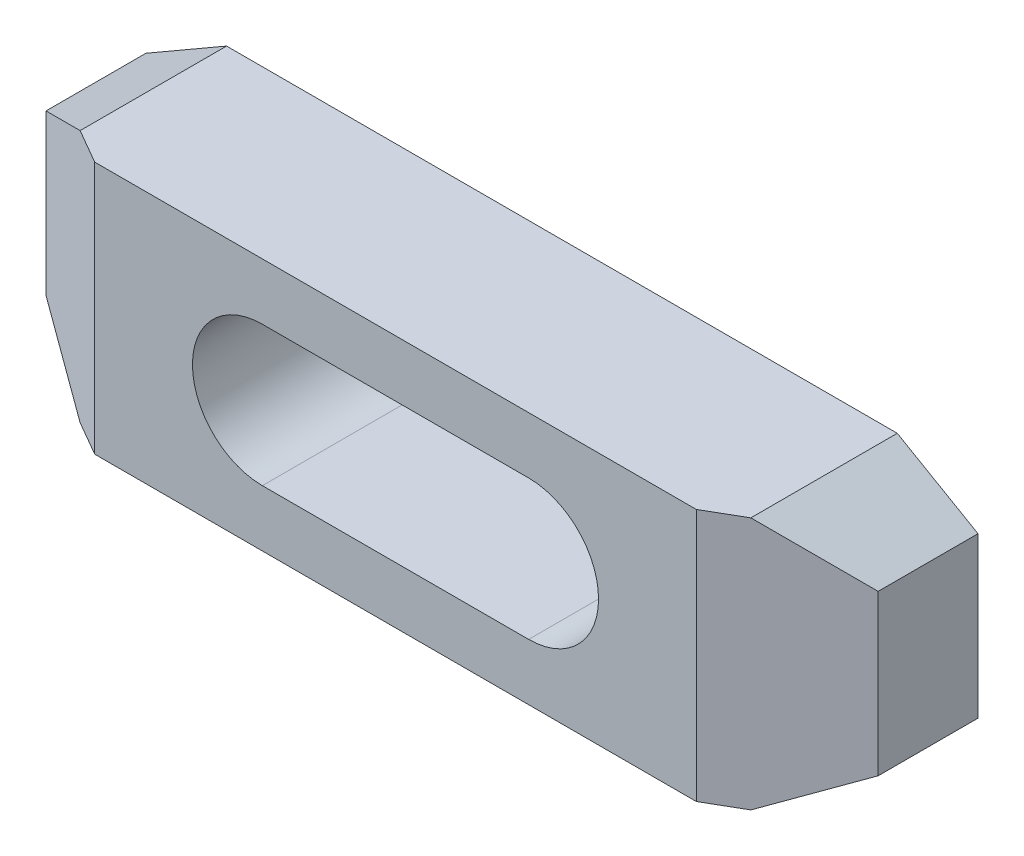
ISO-10303-21;
HEADER;
FILE_DESCRIPTION(('STEP AP214'),'2;1');
FILE_NAME('part.step','',(''),(''),'','','');
FILE_SCHEMA(('AUTOMOTIVE_DESIGN { 1 0 10303 214 1 1 1 1 }'));
ENDSEC;
DATA;
#1=APPLICATION_CONTEXT('core data for automotive mechanical design processes');
#2=APPLICATION_PROTOCOL_DEFINITION('international standard','automotive_design',2000,#1);
#3=PRODUCT_CONTEXT('',#1,'mechanical');
#4=PRODUCT('Part','Part','',(#3));
#5=PRODUCT_RELATED_PRODUCT_CATEGORY('part','',(#4));
#6=PRODUCT_DEFINITION_FORMATION('','',#4);
#7=PRODUCT_DEFINITION_CONTEXT('part definition',#1,'design');
#8=PRODUCT_DEFINITION('design','',#6,#7);
#9=PRODUCT_DEFINITION_SHAPE('','',#8);
#10=(LENGTH_UNIT() NAMED_UNIT(*) SI_UNIT(.MILLI.,.METRE.));
#11=(NAMED_UNIT(*) PLANE_ANGLE_UNIT() SI_UNIT($,.RADIAN.));
#12=(NAMED_UNIT(*) SI_UNIT($,.STERADIAN.) SOLID_ANGLE_UNIT());
#13=UNCERTAINTY_MEASURE_WITH_UNIT(LENGTH_MEASURE(1.E-05),#10,'distance_accuracy_value','');
#14=(GEOMETRIC_REPRESENTATION_CONTEXT(3) GLOBAL_UNCERTAINTY_ASSIGNED_CONTEXT((#13)) GLOBAL_UNIT_ASSIGNED_CONTEXT((#10,
#11,#12)) REPRESENTATION_CONTEXT('',''));
#15=CARTESIAN_POINT('',(0.,0.,0.));
#16=DIRECTION('',(0.,0.,1.));
#17=DIRECTION('',(1.,0.,0.));
#18=AXIS2_PLACEMENT_3D('',#15,#16,#17);
#19=CARTESIAN_POINT('',(0.,-48.0843918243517,25.));
#20=DIRECTION('',(0.,0.,-1.));
#21=DIRECTION('',(-1.,0.,0.));
#22=AXIS2_PLACEMENT_3D('',#19,#20,#21);
#23=PLANE('',#22);
#24=CARTESIAN_POINT('',(20.,0.,25.));
#25=DIRECTION('',(0.,0.,1.));
#26=DIRECTION('',(1.,0.,0.));
#27=AXIS2_PLACEMENT_3D('',#24,#25,#26);
#28=CIRCLE('',#27,10.5);
#29=CARTESIAN_POINT('',(20.,-10.5,25.));
#30=VERTEX_POINT('',#29);
#31=CARTESIAN_POINT('',(20.,10.5,25.));
#32=VERTEX_POINT('',#31);
#33=EDGE_CURVE('E200',#30,#32,#28,.T.);
#34=ORIENTED_EDGE('',*,*,#33,.F.);
#35=DIRECTION('',(-1.,0.,0.));
#36=VECTOR('',#35,1.);
#37=CARTESIAN_POINT('',(20.,-10.5,25.));
#38=LINE('',#37,#36);
#39=CARTESIAN_POINT('',(-20.,-10.5,25.));
#40=VERTEX_POINT('',#39);
#41=EDGE_CURVE('E199',#30,#40,#38,.T.);
#42=ORIENTED_EDGE('',*,*,#41,.T.);
#43=CARTESIAN_POINT('',(-20.,0.,25.));
#44=DIRECTION('',(0.,0.,1.));
#45=DIRECTION('',(1.,0.,0.));
#46=AXIS2_PLACEMENT_3D('',#43,#44,#45);
#47=CIRCLE('',#46,10.5);
#48=CARTESIAN_POINT('',(-20.,10.5,25.));
#49=VERTEX_POINT('',#48);
#50=EDGE_CURVE('E207',#49,#40,#47,.T.);
#51=ORIENTED_EDGE('',*,*,#50,.F.);
#52=DIRECTION('',(-1.,0.,0.));
#53=VECTOR('',#52,1.);
#54=CARTESIAN_POINT('',(20.,10.5,25.));
#55=LINE('',#54,#53);
#56=EDGE_CURVE('E203',#32,#49,#55,.T.);
#57=ORIENTED_EDGE('',*,*,#56,.F.);
#58=EDGE_LOOP('',(#34,#42,#51,#57));
#59=FACE_BOUND('',#58,.T.);
#60=DIRECTION('',(0.,1.,0.));
#61=VECTOR('',#60,1.);
#62=CARTESIAN_POINT('',(-45.179491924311,-48.0843918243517,25.));
#63=LINE('',#62,#61);
#64=CARTESIAN_POINT('',(-45.179491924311,-19.,25.));
#65=VERTEX_POINT('',#64);
#66=CARTESIAN_POINT('',(-45.179491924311,19.,25.));
#67=VERTEX_POINT('',#66);
#68=EDGE_CURVE('E128',#65,#67,#63,.T.);
#69=ORIENTED_EDGE('',*,*,#68,.F.);
#70=DIRECTION('',(-1.,0.,0.));
#71=VECTOR('',#70,1.);
#72=CARTESIAN_POINT('',(50.3756443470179,-19.,25.));
#73=LINE('',#72,#71);
#74=CARTESIAN_POINT('',(45.1794919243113,-19.,25.));
#75=VERTEX_POINT('',#74);
#76=EDGE_CURVE('E168',#75,#65,#73,.T.);
#77=ORIENTED_EDGE('',*,*,#76,.F.);
#78=DIRECTION('',(0.,1.,0.));
#79=VECTOR('',#78,1.);
#80=CARTESIAN_POINT('',(45.1794919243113,-48.0843918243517,25.));
#81=LINE('',#80,#79);
#82=CARTESIAN_POINT('',(45.1794919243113,19.,25.));
#83=VERTEX_POINT('',#82);
#84=EDGE_CURVE('E36',#75,#83,#81,.T.);
#85=ORIENTED_EDGE('',*,*,#84,.T.);
#86=DIRECTION('',(1.,0.,0.));
#87=VECTOR('',#86,1.);
#88=CARTESIAN_POINT('',(-50.3756443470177,19.,25.));
#89=LINE('',#88,#87);
#90=EDGE_CURVE('E167',#67,#83,#89,.T.);
#91=ORIENTED_EDGE('',*,*,#90,.F.);
#92=EDGE_LOOP('',(#69,#77,#85,#91));
#93=FACE_BOUND('',#92,.T.);
#94=ADVANCED_FACE('F14',(#59,#93),#23,.F.);
#95=CARTESIAN_POINT('',(-50.3756443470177,19.,25.));
#96=DIRECTION('',(0.,1.,0.));
#97=DIRECTION('',(-1.,0.,0.));
#98=AXIS2_PLACEMENT_3D('',#95,#96,#97);
#99=PLANE('',#98);
#100=DIRECTION('',(0.,0.,-1.));
#101=VECTOR('',#100,1.);
#102=CARTESIAN_POINT('',(-50.3756443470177,19.,25.));
#103=LINE('',#102,#101);
#104=CARTESIAN_POINT('',(-50.3756443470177,19.,22.));
#105=VERTEX_POINT('',#104);
#106=CARTESIAN_POINT('',(-50.3756443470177,19.,0.));
#107=VERTEX_POINT('',#106);
#108=EDGE_CURVE('E136',#105,#107,#103,.T.);
#109=ORIENTED_EDGE('',*,*,#108,.F.);
#110=DIRECTION('',(0.866025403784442,0.,0.5));
#111=VECTOR('',#110,1.);
#112=CARTESIAN_POINT('',(-49.076606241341,19.,22.75));
#113=LINE('',#112,#111);
#114=EDGE_CURVE('E229',#105,#67,#113,.T.);
#115=ORIENTED_EDGE('',*,*,#114,.T.);
#116=ORIENTED_EDGE('',*,*,#90,.T.);
#117=DIRECTION('',(-0.866025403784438,0.,0.5));
#118=VECTOR('',#117,1.);
#119=CARTESIAN_POINT('',(-26.4868602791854,19.,66.3765877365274));
#120=LINE('',#119,#118);
#121=CARTESIAN_POINT('',(50.3756443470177,19.,22.));
#122=VERTEX_POINT('',#121);
#123=EDGE_CURVE('E224',#122,#83,#120,.T.);
#124=ORIENTED_EDGE('',*,*,#123,.F.);
#125=DIRECTION('',(0.,0.,-1.));
#126=VECTOR('',#125,1.);
#127=CARTESIAN_POINT('',(50.3756443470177,19.,25.));
#128=LINE('',#127,#126);
#129=CARTESIAN_POINT('',(50.3756443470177,19.,0.));
#130=VERTEX_POINT('',#129);
#131=EDGE_CURVE('E143',#122,#130,#128,.T.);
#132=ORIENTED_EDGE('',*,*,#131,.T.);
#133=DIRECTION('',(1.,0.,0.));
#134=VECTOR('',#133,1.);
#135=CARTESIAN_POINT('',(-50.3756443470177,19.,0.));
#136=LINE('',#135,#134);
#137=EDGE_CURVE('E183',#107,#130,#136,.T.);
#138=ORIENTED_EDGE('',*,*,#137,.F.);
#139=EDGE_LOOP('',(#109,#115,#116,#124,#132,#138));
#140=FACE_BOUND('',#139,.T.);
#141=ADVANCED_FACE('F237',(#140),#99,.T.);
#142=CARTESIAN_POINT('',(-62.5,12.,25.));
#143=DIRECTION('',(-0.5,0.866025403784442,0.));
#144=DIRECTION('',(-0.866025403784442,-0.5,0.));
#145=AXIS2_PLACEMENT_3D('',#142,#143,#144);
#146=PLANE('',#145);
#147=DIRECTION('',(0.,0.,-1.));
#148=VECTOR('',#147,1.);
#149=CARTESIAN_POINT('',(-62.5,12.,25.));
#150=LINE('',#149,#148);
#151=CARTESIAN_POINT('',(-62.5,12.,15.));
#152=VERTEX_POINT('',#151);
#153=CARTESIAN_POINT('',(-62.5,12.,0.));
#154=VERTEX_POINT('',#153);
#155=EDGE_CURVE('E134',#152,#154,#150,.T.);
#156=ORIENTED_EDGE('',*,*,#155,.F.);
#157=DIRECTION('',(0.774596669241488,0.447213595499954,0.447213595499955));
#158=VECTOR('',#157,1.);
#159=CARTESIAN_POINT('',(-59.0358983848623,14.,17.));
#160=LINE('',#159,#158);
#161=EDGE_CURVE('E116',#152,#105,#160,.T.);
#162=ORIENTED_EDGE('',*,*,#161,.T.);
#163=ORIENTED_EDGE('',*,*,#108,.T.);
#164=DIRECTION('',(0.866025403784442,0.5,0.));
#165=VECTOR('',#164,1.);
#166=CARTESIAN_POINT('',(-62.5,12.,0.));
#167=LINE('',#166,#165);
#168=EDGE_CURVE('E180',#154,#107,#167,.T.);
#169=ORIENTED_EDGE('',*,*,#168,.F.);
#170=EDGE_LOOP('',(#156,#162,#163,#169));
#171=FACE_BOUND('',#170,.T.);
#172=ADVANCED_FACE('F253',(#171),#146,.T.);
#173=CARTESIAN_POINT('',(-62.5,-12.,25.));
#174=DIRECTION('',(-1.,0.,0.));
#175=DIRECTION('',(0.,0.,1.));
#176=AXIS2_PLACEMENT_3D('',#173,#174,#175);
#177=PLANE('',#176);
#178=DIRECTION('',(0.,0.,-1.));
#179=VECTOR('',#178,1.);
#180=CARTESIAN_POINT('',(-62.5,-12.,25.));
#181=LINE('',#180,#179);
#182=CARTESIAN_POINT('',(-62.5,-12.,15.));
#183=VERTEX_POINT('',#182);
#184=CARTESIAN_POINT('',(-62.5,-12.,0.));
#185=VERTEX_POINT('',#184);
#186=EDGE_CURVE('E125',#183,#185,#181,.T.);
#187=ORIENTED_EDGE('',*,*,#186,.F.);
#188=DIRECTION('',(0.,1.,0.));
#189=VECTOR('',#188,1.);
#190=CARTESIAN_POINT('',(-62.5,-20.,15.));
#191=LINE('',#190,#189);
#192=EDGE_CURVE('E113',#183,#152,#191,.T.);
#193=ORIENTED_EDGE('',*,*,#192,.T.);
#194=ORIENTED_EDGE('',*,*,#155,.T.);
#195=DIRECTION('',(0.,1.,0.));
#196=VECTOR('',#195,1.);
#197=CARTESIAN_POINT('',(-62.5,-12.,0.));
#198=LINE('',#197,#196);
#199=EDGE_CURVE('E133',#185,#154,#198,.T.);
#200=ORIENTED_EDGE('',*,*,#199,.F.);
#201=EDGE_LOOP('',(#187,#193,#194,#200));
#202=FACE_BOUND('',#201,.T.);
#203=ADVANCED_FACE('F131',(#202),#177,.T.);
#204=CARTESIAN_POINT('',(-50.3756443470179,-19.,25.));
#205=DIRECTION('',(-0.5,-0.866025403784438,0.));
#206=DIRECTION('',(0.866025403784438,-0.5,0.));
#207=AXIS2_PLACEMENT_3D('',#204,#205,#206);
#208=PLANE('',#207);
#209=DIRECTION('',(0.,0.,-1.));
#210=VECTOR('',#209,1.);
#211=CARTESIAN_POINT('',(-50.3756443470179,-19.,25.));
#212=LINE('',#211,#210);
#213=CARTESIAN_POINT('',(-50.3756443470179,-19.,22.));
#214=VERTEX_POINT('',#213);
#215=CARTESIAN_POINT('',(-50.3756443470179,-19.,0.));
#216=VERTEX_POINT('',#215);
#217=EDGE_CURVE('E127',#214,#216,#212,.T.);
#218=ORIENTED_EDGE('',*,*,#217,.F.);
#219=DIRECTION('',(-0.774596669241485,0.447213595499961,-0.447213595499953));
#220=VECTOR('',#219,1.);
#221=CARTESIAN_POINT('',(-49.3364138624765,-19.6,22.6));
#222=LINE('',#221,#220);
#223=EDGE_CURVE('E29',#214,#183,#222,.T.);
#224=ORIENTED_EDGE('',*,*,#223,.T.);
#225=ORIENTED_EDGE('',*,*,#186,.T.);
#226=DIRECTION('',(-0.866025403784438,0.5,0.));
#227=VECTOR('',#226,1.);
#228=CARTESIAN_POINT('',(-50.3756443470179,-19.,0.));
#229=LINE('',#228,#227);
#230=EDGE_CURVE('E177',#216,#185,#229,.T.);
#231=ORIENTED_EDGE('',*,*,#230,.F.);
#232=EDGE_LOOP('',(#218,#224,#225,#231));
#233=FACE_BOUND('',#232,.T.);
#234=ADVANCED_FACE('F123',(#233),#208,.T.);
#235=CARTESIAN_POINT('',(50.3756443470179,-19.,25.));
#236=DIRECTION('',(0.,-1.,0.));
#237=DIRECTION('',(1.,0.,0.));
#238=AXIS2_PLACEMENT_3D('',#235,#236,#237);
#239=PLANE('',#238);
#240=ORIENTED_EDGE('',*,*,#76,.T.);
#241=DIRECTION('',(-0.866025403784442,0.,-0.5));
#242=VECTOR('',#241,1.);
#243=CARTESIAN_POINT('',(26.4868602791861,-19.,66.3765877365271));
#244=LINE('',#243,#242);
#245=EDGE_CURVE('E9',#65,#214,#244,.T.);
#246=ORIENTED_EDGE('',*,*,#245,.T.);
#247=ORIENTED_EDGE('',*,*,#217,.T.);
#248=DIRECTION('',(-1.,0.,0.));
#249=VECTOR('',#248,1.);
#250=CARTESIAN_POINT('',(50.3756443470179,-19.,0.));
#251=LINE('',#250,#249);
#252=CARTESIAN_POINT('',(50.3756443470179,-19.,0.));
#253=VERTEX_POINT('',#252);
#254=EDGE_CURVE('E166',#253,#216,#251,.T.);
#255=ORIENTED_EDGE('',*,*,#254,.F.);
#256=DIRECTION('',(0.,0.,-1.));
#257=VECTOR('',#256,1.);
#258=CARTESIAN_POINT('',(50.3756443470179,-19.,25.));
#259=LINE('',#258,#257);
#260=CARTESIAN_POINT('',(50.3756443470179,-19.,22.));
#261=VERTEX_POINT('',#260);
#262=EDGE_CURVE('E138',#261,#253,#259,.T.);
#263=ORIENTED_EDGE('',*,*,#262,.F.);
#264=DIRECTION('',(0.866025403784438,0.,-0.5));
#265=VECTOR('',#264,1.);
#266=CARTESIAN_POINT('',(49.0766062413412,-19.,22.75));
#267=LINE('',#266,#265);
#268=EDGE_CURVE('E22',#75,#261,#267,.T.);
#269=ORIENTED_EDGE('',*,*,#268,.F.);
#270=EDGE_LOOP('',(#240,#246,#247,#255,#263,#269));
#271=FACE_BOUND('',#270,.T.);
#272=ADVANCED_FACE('F164',(#271),#239,.T.);
#273=CARTESIAN_POINT('',(0.,-48.0843918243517,0.));
#274=DIRECTION('',(0.,0.,-1.));
#275=DIRECTION('',(-1.,0.,0.));
#276=AXIS2_PLACEMENT_3D('',#273,#274,#275);
#277=PLANE('',#276);
#278=DIRECTION('',(-0.866025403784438,-0.5,0.));
#279=VECTOR('',#278,1.);
#280=CARTESIAN_POINT('',(62.5,-12.,0.));
#281=LINE('',#280,#279);
#282=CARTESIAN_POINT('',(62.5,-12.,0.));
#283=VERTEX_POINT('',#282);
#284=EDGE_CURVE('E173',#283,#253,#281,.T.);
#285=ORIENTED_EDGE('',*,*,#284,.T.);
#286=ORIENTED_EDGE('',*,*,#254,.T.);
#287=ORIENTED_EDGE('',*,*,#230,.T.);
#288=ORIENTED_EDGE('',*,*,#199,.T.);
#289=ORIENTED_EDGE('',*,*,#168,.T.);
#290=ORIENTED_EDGE('',*,*,#137,.T.);
#291=DIRECTION('',(0.866025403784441,-0.5,0.));
#292=VECTOR('',#291,1.);
#293=CARTESIAN_POINT('',(50.3756443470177,19.,0.));
#294=LINE('',#293,#292);
#295=CARTESIAN_POINT('',(62.5,12.,0.));
#296=VERTEX_POINT('',#295);
#297=EDGE_CURVE('E186',#130,#296,#294,.T.);
#298=ORIENTED_EDGE('',*,*,#297,.T.);
#299=DIRECTION('',(0.,-1.,0.));
#300=VECTOR('',#299,1.);
#301=CARTESIAN_POINT('',(62.5,12.,0.));
#302=LINE('',#301,#300);
#303=EDGE_CURVE('E171',#296,#283,#302,.T.);
#304=ORIENTED_EDGE('',*,*,#303,.T.);
#305=EDGE_LOOP('',(#285,#286,#287,#288,#289,#290,#298,#304));
#306=FACE_BOUND('',#305,.T.);
#307=DIRECTION('',(-1.,0.,0.));
#308=VECTOR('',#307,1.);
#309=CARTESIAN_POINT('',(20.,-10.5,0.));
#310=LINE('',#309,#308);
#311=CARTESIAN_POINT('',(20.,-10.5,0.));
#312=VERTEX_POINT('',#311);
#313=CARTESIAN_POINT('',(-20.,-10.5,0.));
#314=VERTEX_POINT('',#313);
#315=EDGE_CURVE('E204',#312,#314,#310,.T.);
#316=ORIENTED_EDGE('',*,*,#315,.F.);
#317=CARTESIAN_POINT('',(20.,0.,0.));
#318=DIRECTION('',(0.,0.,1.));
#319=DIRECTION('',(1.,0.,0.));
#320=AXIS2_PLACEMENT_3D('',#317,#318,#319);
#321=CIRCLE('',#320,10.5);
#322=CARTESIAN_POINT('',(20.,10.5,0.));
#323=VERTEX_POINT('',#322);
#324=EDGE_CURVE('E211',#312,#323,#321,.T.);
#325=ORIENTED_EDGE('',*,*,#324,.T.);
#326=DIRECTION('',(-1.,0.,0.));
#327=VECTOR('',#326,1.);
#328=CARTESIAN_POINT('',(20.,10.5,0.));
#329=LINE('',#328,#327);
#330=CARTESIAN_POINT('',(-20.,10.5,0.));
#331=VERTEX_POINT('',#330);
#332=EDGE_CURVE('E214',#323,#331,#329,.T.);
#333=ORIENTED_EDGE('',*,*,#332,.T.);
#334=CARTESIAN_POINT('',(-20.,0.,0.));
#335=DIRECTION('',(0.,0.,1.));
#336=DIRECTION('',(1.,0.,0.));
#337=AXIS2_PLACEMENT_3D('',#334,#335,#336);
#338=CIRCLE('',#337,10.5);
#339=EDGE_CURVE('E218',#331,#314,#338,.T.);
#340=ORIENTED_EDGE('',*,*,#339,.T.);
#341=EDGE_LOOP('',(#316,#325,#333,#340));
#342=FACE_BOUND('',#341,.T.);
#343=ADVANCED_FACE('F241',(#306,#342),#277,.T.);
#344=CARTESIAN_POINT('',(62.5,-12.,25.));
#345=DIRECTION('',(0.5,-0.866025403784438,0.));
#346=DIRECTION('',(0.866025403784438,0.5,0.));
#347=AXIS2_PLACEMENT_3D('',#344,#345,#346);
#348=PLANE('',#347);
#349=DIRECTION('',(0.774596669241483,0.447213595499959,-0.447213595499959));
#350=VECTOR('',#349,1.);
#351=CARTESIAN_POINT('',(59.0358983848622,-14.,17.));
#352=LINE('',#351,#350);
#353=CARTESIAN_POINT('',(62.5,-12.,15.));
#354=VERTEX_POINT('',#353);
#355=EDGE_CURVE('E150',#261,#354,#352,.T.);
#356=ORIENTED_EDGE('',*,*,#355,.F.);
#357=ORIENTED_EDGE('',*,*,#262,.T.);
#358=ORIENTED_EDGE('',*,*,#284,.F.);
#359=DIRECTION('',(0.,0.,-1.));
#360=VECTOR('',#359,1.);
#361=CARTESIAN_POINT('',(62.5,-12.,25.));
#362=LINE('',#361,#360);
#363=EDGE_CURVE('E147',#354,#283,#362,.T.);
#364=ORIENTED_EDGE('',*,*,#363,.F.);
#365=EDGE_LOOP('',(#356,#357,#358,#364));
#366=FACE_BOUND('',#365,.T.);
#367=ADVANCED_FACE('F158',(#366),#348,.T.);
#368=CARTESIAN_POINT('',(62.5,12.,25.));
#369=DIRECTION('',(1.,0.,0.));
#370=DIRECTION('',(0.,0.,-1.));
#371=AXIS2_PLACEMENT_3D('',#368,#369,#370);
#372=PLANE('',#371);
#373=DIRECTION('',(0.,1.,0.));
#374=VECTOR('',#373,1.);
#375=CARTESIAN_POINT('',(62.5,-20.,15.));
#376=LINE('',#375,#374);
#377=CARTESIAN_POINT('',(62.5,12.,15.));
#378=VERTEX_POINT('',#377);
#379=EDGE_CURVE('E161',#354,#378,#376,.T.);
#380=ORIENTED_EDGE('',*,*,#379,.F.);
#381=ORIENTED_EDGE('',*,*,#363,.T.);
#382=ORIENTED_EDGE('',*,*,#303,.F.);
#383=DIRECTION('',(0.,0.,-1.));
#384=VECTOR('',#383,1.);
#385=CARTESIAN_POINT('',(62.5,12.,25.));
#386=LINE('',#385,#384);
#387=EDGE_CURVE('E145',#378,#296,#386,.T.);
#388=ORIENTED_EDGE('',*,*,#387,.F.);
#389=EDGE_LOOP('',(#380,#381,#382,#388));
#390=FACE_BOUND('',#389,.T.);
#391=ADVANCED_FACE('F16',(#390),#372,.T.);
#392=CARTESIAN_POINT('',(50.3756443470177,19.,25.));
#393=DIRECTION('',(0.5,0.866025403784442,0.));
#394=DIRECTION('',(-0.866025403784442,0.5,0.));
#395=AXIS2_PLACEMENT_3D('',#392,#393,#394);
#396=PLANE('',#395);
#397=DIRECTION('',(-0.774596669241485,0.447213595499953,0.44721359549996));
#398=VECTOR('',#397,1.);
#399=CARTESIAN_POINT('',(49.3364138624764,19.6,22.6));
#400=LINE('',#399,#398);
#401=EDGE_CURVE('E215',#378,#122,#400,.T.);
#402=ORIENTED_EDGE('',*,*,#401,.F.);
#403=ORIENTED_EDGE('',*,*,#387,.T.);
#404=ORIENTED_EDGE('',*,*,#297,.F.);
#405=ORIENTED_EDGE('',*,*,#131,.F.);
#406=EDGE_LOOP('',(#402,#403,#404,#405));
#407=FACE_BOUND('',#406,.T.);
#408=ADVANCED_FACE('F250',(#407),#396,.T.);
#409=CARTESIAN_POINT('',(20.,0.,25.));
#410=DIRECTION('',(0.,0.,-1.));
#411=DIRECTION('',(-1.,0.,0.));
#412=AXIS2_PLACEMENT_3D('',#409,#410,#411);
#413=CYLINDRICAL_SURFACE('',#412,10.5);
#414=DIRECTION('',(0.,0.,-1.));
#415=VECTOR('',#414,1.);
#416=CARTESIAN_POINT('',(20.,10.5,25.));
#417=LINE('',#416,#415);
#418=EDGE_CURVE('E175',#32,#323,#417,.T.);
#419=ORIENTED_EDGE('',*,*,#418,.T.);
#420=ORIENTED_EDGE('',*,*,#324,.F.);
#421=DIRECTION('',(0.,0.,-1.));
#422=VECTOR('',#421,1.);
#423=CARTESIAN_POINT('',(20.,-10.5,25.));
#424=LINE('',#423,#422);
#425=EDGE_CURVE('E196',#30,#312,#424,.T.);
#426=ORIENTED_EDGE('',*,*,#425,.F.);
#427=ORIENTED_EDGE('',*,*,#33,.T.);
#428=EDGE_LOOP('',(#419,#420,#426,#427));
#429=FACE_BOUND('',#428,.T.);
#430=ADVANCED_FACE('F312',(#429),#413,.F.);
#431=CARTESIAN_POINT('',(20.,10.5,25.));
#432=DIRECTION('',(0.,-1.,0.));
#433=DIRECTION('',(1.,0.,0.));
#434=AXIS2_PLACEMENT_3D('',#431,#432,#433);
#435=PLANE('',#434);
#436=DIRECTION('',(0.,0.,-1.));
#437=VECTOR('',#436,1.);
#438=CARTESIAN_POINT('',(-20.,10.5,25.));
#439=LINE('',#438,#437);
#440=EDGE_CURVE('E192',#49,#331,#439,.T.);
#441=ORIENTED_EDGE('',*,*,#440,.T.);
#442=ORIENTED_EDGE('',*,*,#332,.F.);
#443=ORIENTED_EDGE('',*,*,#418,.F.);
#444=ORIENTED_EDGE('',*,*,#56,.T.);
#445=EDGE_LOOP('',(#441,#442,#443,#444));
#446=FACE_BOUND('',#445,.T.);
#447=ADVANCED_FACE('F319',(#446),#435,.T.);
#448=CARTESIAN_POINT('',(-20.,0.,25.));
#449=DIRECTION('',(0.,0.,-1.));
#450=DIRECTION('',(-1.,0.,0.));
#451=AXIS2_PLACEMENT_3D('',#448,#449,#450);
#452=CYLINDRICAL_SURFACE('',#451,10.5);
#453=DIRECTION('',(0.,0.,-1.));
#454=VECTOR('',#453,1.);
#455=CARTESIAN_POINT('',(-20.,-10.5,25.));
#456=LINE('',#455,#454);
#457=EDGE_CURVE('E194',#40,#314,#456,.T.);
#458=ORIENTED_EDGE('',*,*,#457,.T.);
#459=ORIENTED_EDGE('',*,*,#339,.F.);
#460=ORIENTED_EDGE('',*,*,#440,.F.);
#461=ORIENTED_EDGE('',*,*,#50,.T.);
#462=EDGE_LOOP('',(#458,#459,#460,#461));
#463=FACE_BOUND('',#462,.T.);
#464=ADVANCED_FACE('F328',(#463),#452,.F.);
#465=CARTESIAN_POINT('',(20.,-10.5,25.));
#466=DIRECTION('',(0.,-1.,0.));
#467=DIRECTION('',(1.,0.,0.));
#468=AXIS2_PLACEMENT_3D('',#465,#466,#467);
#469=PLANE('',#468);
#470=ORIENTED_EDGE('',*,*,#41,.F.);
#471=ORIENTED_EDGE('',*,*,#425,.T.);
#472=ORIENTED_EDGE('',*,*,#315,.T.);
#473=ORIENTED_EDGE('',*,*,#457,.F.);
#474=EDGE_LOOP('',(#470,#471,#472,#473));
#475=FACE_BOUND('',#474,.T.);
#476=ADVANCED_FACE('F336',(#475),#469,.F.);
#477=CARTESIAN_POINT('',(62.5,-20.,15.));
#478=DIRECTION('',(-0.5,0.,-0.866025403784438));
#479=DIRECTION('',(-0.866025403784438,0.,0.5));
#480=AXIS2_PLACEMENT_3D('',#477,#478,#479);
#481=PLANE('',#480);
#482=ORIENTED_EDGE('',*,*,#401,.T.);
#483=ORIENTED_EDGE('',*,*,#123,.T.);
#484=ORIENTED_EDGE('',*,*,#84,.F.);
#485=ORIENTED_EDGE('',*,*,#268,.T.);
#486=ORIENTED_EDGE('',*,*,#355,.T.);
#487=ORIENTED_EDGE('',*,*,#379,.T.);
#488=EDGE_LOOP('',(#482,#483,#484,#485,#486,#487));
#489=FACE_BOUND('',#488,.T.);
#490=ADVANCED_FACE('F149',(#489),#481,.F.);
#491=CARTESIAN_POINT('',(-62.5,-20.,15.));
#492=DIRECTION('',(-0.5,0.,0.866025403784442));
#493=DIRECTION('',(0.866025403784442,0.,0.5));
#494=AXIS2_PLACEMENT_3D('',#491,#492,#493);
#495=PLANE('',#494);
#496=ORIENTED_EDGE('',*,*,#192,.F.);
#497=ORIENTED_EDGE('',*,*,#223,.F.);
#498=ORIENTED_EDGE('',*,*,#245,.F.);
#499=ORIENTED_EDGE('',*,*,#68,.T.);
#500=ORIENTED_EDGE('',*,*,#114,.F.);
#501=ORIENTED_EDGE('',*,*,#161,.F.);
#502=EDGE_LOOP('',(#496,#497,#498,#499,#500,#501));
#503=FACE_BOUND('',#502,.T.);
#504=ADVANCED_FACE('F114',(#503),#495,.T.);
#505=CLOSED_SHELL('',(#94,#141,#172,#203,#234,#272,#343,#367,#391,#408,#430,#447,#464,#476,#490,#504));
#506=MANIFOLD_SOLID_BREP('B1',#505);
#507=ADVANCED_BREP_SHAPE_REPRESENTATION('',(#18,#506),#14);
#508=SHAPE_DEFINITION_REPRESENTATION(#9,#507);
ENDSEC;
END-ISO-10303-21;
